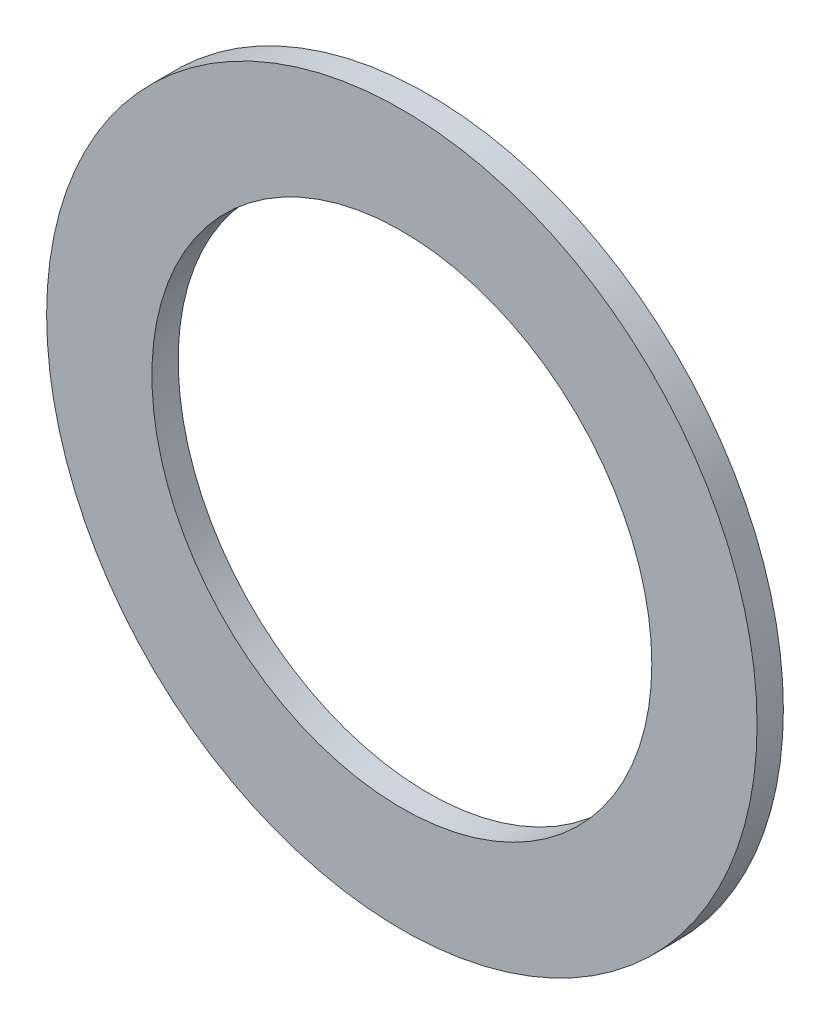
ISO-10303-21;
HEADER;
FILE_DESCRIPTION(('STEP AP214'),'2;1');
FILE_NAME('part.step','',(''),(''),'','','');
FILE_SCHEMA(('AUTOMOTIVE_DESIGN { 1 0 10303 214 1 1 1 1 }'));
ENDSEC;
DATA;
#1=APPLICATION_CONTEXT('core data for automotive mechanical design processes');
#2=APPLICATION_PROTOCOL_DEFINITION('international standard','automotive_design',2000,#1);
#3=PRODUCT_CONTEXT('',#1,'mechanical');
#4=PRODUCT('Part','Part','',(#3));
#5=PRODUCT_RELATED_PRODUCT_CATEGORY('part','',(#4));
#6=PRODUCT_DEFINITION_FORMATION('','',#4);
#7=PRODUCT_DEFINITION_CONTEXT('part definition',#1,'design');
#8=PRODUCT_DEFINITION('design','',#6,#7);
#9=PRODUCT_DEFINITION_SHAPE('','',#8);
#10=(LENGTH_UNIT() NAMED_UNIT(*) SI_UNIT(.MILLI.,.METRE.));
#11=(NAMED_UNIT(*) PLANE_ANGLE_UNIT() SI_UNIT($,.RADIAN.));
#12=(NAMED_UNIT(*) SI_UNIT($,.STERADIAN.) SOLID_ANGLE_UNIT());
#13=UNCERTAINTY_MEASURE_WITH_UNIT(LENGTH_MEASURE(1.E-05),#10,'distance_accuracy_value','');
#14=(GEOMETRIC_REPRESENTATION_CONTEXT(3) GLOBAL_UNCERTAINTY_ASSIGNED_CONTEXT((#13)) GLOBAL_UNIT_ASSIGNED_CONTEXT((#10,
#11,#12)) REPRESENTATION_CONTEXT('',''));
#15=CARTESIAN_POINT('',(0.,0.,0.));
#16=DIRECTION('',(0.,0.,1.));
#17=DIRECTION('',(1.,0.,0.));
#18=AXIS2_PLACEMENT_3D('',#15,#16,#17);
#19=CARTESIAN_POINT('',(0.,0.,0.25));
#20=DIRECTION('',(0.,0.,1.));
#21=DIRECTION('',(1.,0.,0.));
#22=AXIS2_PLACEMENT_3D('',#19,#20,#21);
#23=PLANE('',#22);
#24=CARTESIAN_POINT('',(0.,0.,0.25));
#25=DIRECTION('',(0.,0.,1.));
#26=DIRECTION('',(1.,0.,0.));
#27=AXIS2_PLACEMENT_3D('',#24,#25,#26);
#28=CIRCLE('',#27,6.75);
#29=CARTESIAN_POINT('',(6.75,0.,0.25));
#30=VERTEX_POINT('',#29);
#31=EDGE_CURVE('E10',#30,#30,#28,.T.);
#32=ORIENTED_EDGE('',*,*,#31,.T.);
#33=EDGE_LOOP('',(#32));
#34=FACE_BOUND('',#33,.T.);
#35=CARTESIAN_POINT('',(0.,0.,0.25));
#36=DIRECTION('',(0.,0.,1.));
#37=DIRECTION('',(1.,0.,0.));
#38=AXIS2_PLACEMENT_3D('',#35,#36,#37);
#39=CIRCLE('',#38,4.75);
#40=CARTESIAN_POINT('',(4.75,0.,0.25));
#41=VERTEX_POINT('',#40);
#42=EDGE_CURVE('E33',#41,#41,#39,.T.);
#43=ORIENTED_EDGE('',*,*,#42,.F.);
#44=EDGE_LOOP('',(#43));
#45=FACE_BOUND('',#44,.T.);
#46=ADVANCED_FACE('F22',(#34,#45),#23,.T.);
#47=CARTESIAN_POINT('',(0.,0.,-0.25));
#48=DIRECTION('',(0.,0.,1.));
#49=DIRECTION('',(1.,0.,0.));
#50=AXIS2_PLACEMENT_3D('',#47,#48,#49);
#51=PLANE('',#50);
#52=CARTESIAN_POINT('',(0.,0.,-0.25));
#53=DIRECTION('',(0.,0.,1.));
#54=DIRECTION('',(1.,0.,0.));
#55=AXIS2_PLACEMENT_3D('',#52,#53,#54);
#56=CIRCLE('',#55,6.75);
#57=CARTESIAN_POINT('',(6.75,0.,-0.25));
#58=VERTEX_POINT('',#57);
#59=EDGE_CURVE('E29',#58,#58,#56,.T.);
#60=ORIENTED_EDGE('',*,*,#59,.F.);
#61=EDGE_LOOP('',(#60));
#62=FACE_BOUND('',#61,.T.);
#63=CARTESIAN_POINT('',(0.,0.,-0.25));
#64=DIRECTION('',(0.,0.,1.));
#65=DIRECTION('',(1.,0.,0.));
#66=AXIS2_PLACEMENT_3D('',#63,#64,#65);
#67=CIRCLE('',#66,4.75);
#68=CARTESIAN_POINT('',(4.75,0.,-0.25));
#69=VERTEX_POINT('',#68);
#70=EDGE_CURVE('E37',#69,#69,#67,.T.);
#71=ORIENTED_EDGE('',*,*,#70,.T.);
#72=EDGE_LOOP('',(#71));
#73=FACE_BOUND('',#72,.T.);
#74=ADVANCED_FACE('F43',(#62,#73),#51,.F.);
#75=CARTESIAN_POINT('',(0.,0.,0.25));
#76=DIRECTION('',(0.,0.,-1.));
#77=DIRECTION('',(-1.,0.,0.));
#78=AXIS2_PLACEMENT_3D('',#75,#76,#77);
#79=CYLINDRICAL_SURFACE('',#78,6.75);
#80=ORIENTED_EDGE('',*,*,#31,.F.);
#81=EDGE_LOOP('',(#80));
#82=FACE_BOUND('',#81,.T.);
#83=ORIENTED_EDGE('',*,*,#59,.T.);
#84=EDGE_LOOP('',(#83));
#85=FACE_BOUND('',#84,.T.);
#86=ADVANCED_FACE('F24',(#82,#85),#79,.T.);
#87=CARTESIAN_POINT('',(0.,0.,0.25));
#88=DIRECTION('',(0.,0.,-1.));
#89=DIRECTION('',(-1.,0.,0.));
#90=AXIS2_PLACEMENT_3D('',#87,#88,#89);
#91=CYLINDRICAL_SURFACE('',#90,4.75);
#92=ORIENTED_EDGE('',*,*,#42,.T.);
#93=EDGE_LOOP('',(#92));
#94=FACE_BOUND('',#93,.T.);
#95=ORIENTED_EDGE('',*,*,#70,.F.);
#96=EDGE_LOOP('',(#95));
#97=FACE_BOUND('',#96,.T.);
#98=ADVANCED_FACE('F45',(#94,#97),#91,.F.);
#99=CLOSED_SHELL('',(#46,#74,#86,#98));
#100=MANIFOLD_SOLID_BREP('B2',#99);
#101=ADVANCED_BREP_SHAPE_REPRESENTATION('',(#18,#100),#14);
#102=SHAPE_DEFINITION_REPRESENTATION(#9,#101);
ENDSEC;
END-ISO-10303-21;
